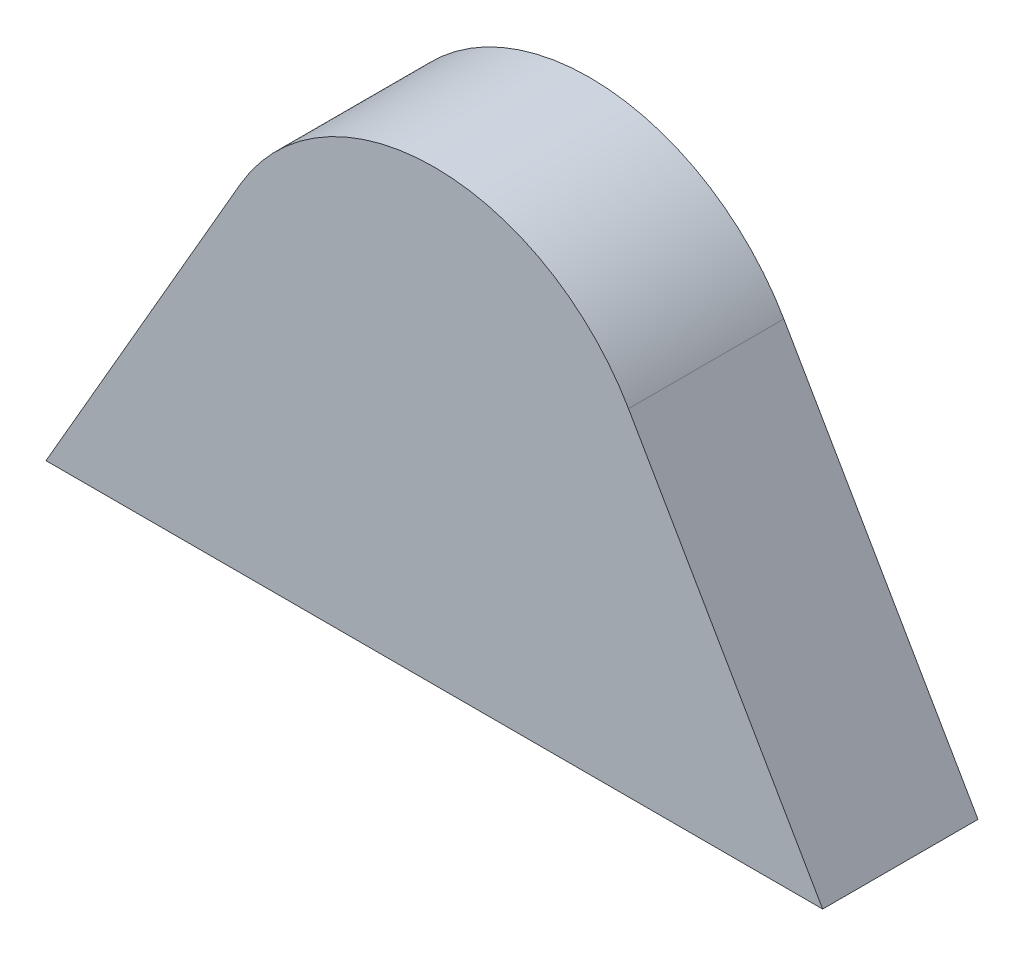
from build123d import *

# Parameters (mm, degrees)
EXTRUDE1_DEPTH = 10


with BuildPart() as part:
    # Sketch1 → Extrude1 (new body)
    with BuildSketch(Plane.XY):
        with BuildLine():
            Line((12.49999978, 21.650634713), (0, 0))
            Line((0, 0), (50, 0))
            Line((50, 0), (37.5, 21.650635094))
            ThreePointArc((37.5, 21.650635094), (24.99999978, 28.867513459), (12.49999978, 21.650634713))
        make_face()
    extrude(amount=EXTRUDE1_DEPTH)


solid = part.part
